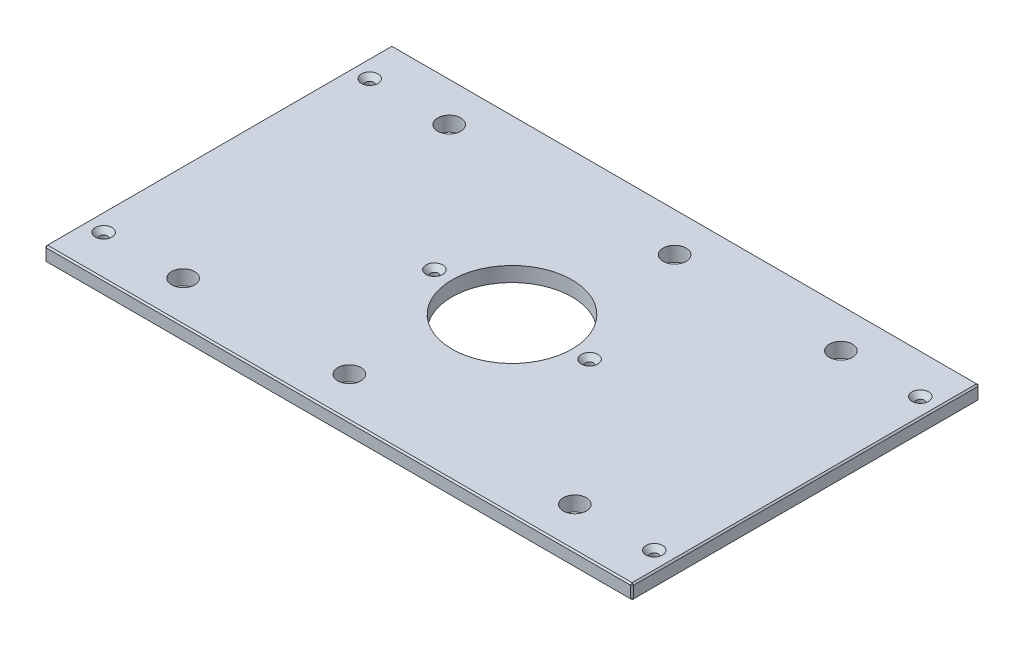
from build123d import *

# Parameters (mm, degrees)
SKETCH1_W                                        = 504.825
SKETCH1_H                                        = 298.45
BOSS_EXTRUDE1_DEPTH                              = 12.7
SKETCH13_R                                       = 51.562
CUT_EXTRUDE6_DEPTH                               = 294.498655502
F_25_32_0_78125_DIAMETER_HOLE1_D                 = 19.84375
CHAMFER2_SIZE                                    = 1.27
CSK_FOR_1_4_FLAT_HEAD_MACHINE_SCREW1_D           = 6.7564
CSK_FOR_1_4_FLAT_HEAD_MACHINE_SCREW1_CSINK_D     = 14.2748
CSK_FOR_1_4_FLAT_HEAD_MACHINE_SCREW1_CSINK_ANGLE = 82


with BuildPart() as part:
    # Sketch1 → Boss-Extrude1 (new body)
    with BuildSketch(Plane(origin=(0, 0, 0), x_dir=(1, 0, 0), z_dir=(0, 1, 0))):
        Rectangle(SKETCH1_W, SKETCH1_H)
    extrude(amount=BOSS_EXTRUDE1_DEPTH)

    # Sketch13 → Cut-Extrude6 (cut, through all)
    with BuildSketch(Plane(origin=(0, 12.7, 0), x_dir=(1, 0, 0), z_dir=(0, 1, 0))):
        with Locations(Location((0, 0, 0), (0, 0, 270))):
            Circle(SKETCH13_R)
    extrude(amount=-CUT_EXTRUDE6_DEPTH, mode=Mode.SUBTRACT)

    # 25_32 _0.78125_ Diameter Hole1 (through all)
    with Locations(Plane(origin=(0, 12.7, 0), x_dir=(1, 0, 0), z_dir=(0, 1, 0))):
        with Locations((168.275, 114.3), (-168.275, 114.3), (168.275, -114.3), (-168.275, -114.3), (25.4, 114.3), (-25.4, -114.3)):
            Hole(F_25_32_0_78125_DIAMETER_HOLE1_D / 2)

    # Chamfer2
    chamfer2_edges = [part.edges().sort_by_distance(p)[0] for p in [
        (252.4125, 12.7, 0),
        (0, 12.7, -149.225),
        (-252.4125, 12.7, 0),
        (0, 0, -149.225),
        (252.4125, 0, 0),
        (0, 0, 149.225),
        (-252.4125, 0, 0),
        (0, 12.7, 149.225),
        (-252.4125, 6.35, -149.225),
        (252.4125, 6.35, -149.225),
        (252.4125, 6.35, 149.225),
        (-252.4125, 6.35, 149.225),
    ]]
    chamfer(chamfer2_edges, length=CHAMFER2_SIZE)

    # CSK for 1_4 Flat Head Machine Screw1 (through all)
    with Locations(Plane(origin=(0, 12.7, 0), x_dir=(1, 0, 0), z_dir=(0, 1, 0))):
        with Locations((236.5375, 114.3), (236.5375, -114.3), (-236.5375, -114.3), (-66.675, 0), (66.675, 0), (-236.5375, 114.3), (-168.275, 114.3), (-168.275, -114.3)):
            CounterSinkHole(CSK_FOR_1_4_FLAT_HEAD_MACHINE_SCREW1_D / 2, CSK_FOR_1_4_FLAT_HEAD_MACHINE_SCREW1_CSINK_D / 2, counter_sink_angle=CSK_FOR_1_4_FLAT_HEAD_MACHINE_SCREW1_CSINK_ANGLE)


solid = part.part
